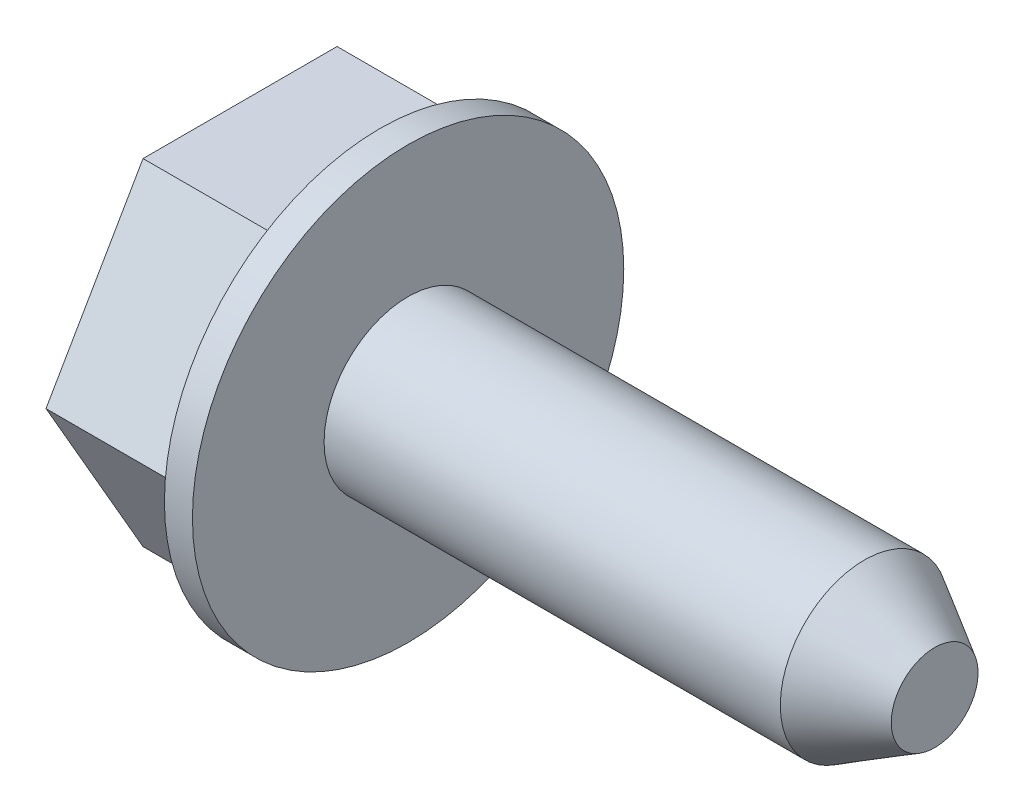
ISO-10303-21;
HEADER;
FILE_DESCRIPTION(('STEP AP214'),'2;1');
FILE_NAME('part.step','',(''),(''),'','','');
FILE_SCHEMA(('AUTOMOTIVE_DESIGN { 1 0 10303 214 1 1 1 1 }'));
ENDSEC;
DATA;
#1=APPLICATION_CONTEXT('core data for automotive mechanical design processes');
#2=APPLICATION_PROTOCOL_DEFINITION('international standard','automotive_design',2000,#1);
#3=PRODUCT_CONTEXT('',#1,'mechanical');
#4=PRODUCT('Part','Part','',(#3));
#5=PRODUCT_RELATED_PRODUCT_CATEGORY('part','',(#4));
#6=PRODUCT_DEFINITION_FORMATION('','',#4);
#7=PRODUCT_DEFINITION_CONTEXT('part definition',#1,'design');
#8=PRODUCT_DEFINITION('design','',#6,#7);
#9=PRODUCT_DEFINITION_SHAPE('','',#8);
#10=(LENGTH_UNIT() NAMED_UNIT(*) SI_UNIT(.MILLI.,.METRE.));
#11=(NAMED_UNIT(*) PLANE_ANGLE_UNIT() SI_UNIT($,.RADIAN.));
#12=(NAMED_UNIT(*) SI_UNIT($,.STERADIAN.) SOLID_ANGLE_UNIT());
#13=UNCERTAINTY_MEASURE_WITH_UNIT(LENGTH_MEASURE(1.E-05),#10,'distance_accuracy_value','');
#14=(GEOMETRIC_REPRESENTATION_CONTEXT(3) GLOBAL_UNCERTAINTY_ASSIGNED_CONTEXT((#13)) GLOBAL_UNIT_ASSIGNED_CONTEXT((#10,
#11,#12)) REPRESENTATION_CONTEXT('',''));
#15=CARTESIAN_POINT('',(0.,0.,0.));
#16=DIRECTION('',(0.,0.,1.));
#17=DIRECTION('',(1.,0.,0.));
#18=AXIS2_PLACEMENT_3D('',#15,#16,#17);
#19=CARTESIAN_POINT('',(0.,0.,0.));
#20=DIRECTION('',(-1.,0.,0.));
#21=DIRECTION('',(0.,0.,1.));
#22=AXIS2_PLACEMENT_3D('',#19,#20,#21);
#23=CYLINDRICAL_SURFACE('',#22,0.762);
#24=CARTESIAN_POINT('',(0.,0.,0.));
#25=DIRECTION('',(-1.,0.,0.));
#26=DIRECTION('',(0.,0.,1.));
#27=AXIS2_PLACEMENT_3D('',#24,#25,#26);
#28=CIRCLE('',#27,0.762);
#29=CARTESIAN_POINT('',(0.,0.,0.762));
#30=VERTEX_POINT('',#29);
#31=EDGE_CURVE('E80',#30,#30,#28,.T.);
#32=ORIENTED_EDGE('',*,*,#31,.F.);
#33=EDGE_LOOP('',(#32));
#34=FACE_BOUND('',#33,.T.);
#35=CARTESIAN_POINT('',(4.13728568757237,0.,0.));
#36=DIRECTION('',(-1.,0.,0.));
#37=DIRECTION('',(0.,0.,1.));
#38=AXIS2_PLACEMENT_3D('',#35,#36,#37);
#39=CIRCLE('',#38,0.762);
#40=CARTESIAN_POINT('',(4.13728568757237,0.,0.762));
#41=VERTEX_POINT('',#40);
#42=EDGE_CURVE('E185',#41,#41,#39,.T.);
#43=ORIENTED_EDGE('',*,*,#42,.T.);
#44=EDGE_LOOP('',(#43));
#45=FACE_BOUND('',#44,.T.);
#46=ADVANCED_FACE('F106',(#34,#45),#23,.T.);
#47=CARTESIAN_POINT('',(-1.27,1.2192,0.));
#48=DIRECTION('',(1.,0.,0.));
#49=DIRECTION('',(0.,0.,-1.));
#50=AXIS2_PLACEMENT_3D('',#47,#48,#49);
#51=PLANE('',#50);
#52=CARTESIAN_POINT('',(-1.27,0.,0.));
#53=DIRECTION('',(-1.,0.,0.));
#54=DIRECTION('',(0.,0.,1.));
#55=AXIS2_PLACEMENT_3D('',#52,#53,#54);
#56=CIRCLE('',#55,1.2192);
#57=CARTESIAN_POINT('',(-1.27,0.,1.2192));
#58=VERTEX_POINT('',#57);
#59=EDGE_CURVE('E217',#58,#58,#56,.T.);
#60=ORIENTED_EDGE('',*,*,#59,.T.);
#61=EDGE_LOOP('',(#60));
#62=FACE_BOUND('',#61,.T.);
#63=ADVANCED_FACE('F108',(#62),#51,.F.);
#64=CARTESIAN_POINT('',(0.,0.762,0.));
#65=DIRECTION('',(-1.,0.,0.));
#66=DIRECTION('',(0.,0.,1.));
#67=AXIS2_PLACEMENT_3D('',#64,#65,#66);
#68=PLANE('',#67);
#69=CARTESIAN_POINT('',(0.,0.,0.));
#70=DIRECTION('',(-1.,0.,0.));
#71=DIRECTION('',(0.,0.,1.));
#72=AXIS2_PLACEMENT_3D('',#69,#70,#71);
#73=CIRCLE('',#72,1.9558);
#74=CARTESIAN_POINT('',(0.,0.,1.9558));
#75=VERTEX_POINT('',#74);
#76=EDGE_CURVE('E114',#75,#75,#73,.T.);
#77=ORIENTED_EDGE('',*,*,#76,.F.);
#78=EDGE_LOOP('',(#77));
#79=FACE_BOUND('',#78,.T.);
#80=ORIENTED_EDGE('',*,*,#31,.T.);
#81=EDGE_LOOP('',(#80));
#82=FACE_BOUND('',#81,.T.);
#83=ADVANCED_FACE('F231',(#79,#82),#68,.F.);
#84=CARTESIAN_POINT('',(0.,0.,0.));
#85=DIRECTION('',(-1.,0.,0.));
#86=DIRECTION('',(0.,0.,1.));
#87=AXIS2_PLACEMENT_3D('',#84,#85,#86);
#88=CYLINDRICAL_SURFACE('',#87,1.9558);
#89=CARTESIAN_POINT('',(-0.254,0.,0.));
#90=DIRECTION('',(-1.,0.,0.));
#91=DIRECTION('',(0.,0.,1.));
#92=AXIS2_PLACEMENT_3D('',#89,#90,#91);
#93=CIRCLE('',#92,1.9558);
#94=CARTESIAN_POINT('',(-0.254,0.,1.9558));
#95=VERTEX_POINT('',#94);
#96=EDGE_CURVE('E224',#95,#95,#93,.T.);
#97=ORIENTED_EDGE('',*,*,#96,.F.);
#98=EDGE_LOOP('',(#97));
#99=FACE_BOUND('',#98,.T.);
#100=ORIENTED_EDGE('',*,*,#76,.T.);
#101=EDGE_LOOP('',(#100));
#102=FACE_BOUND('',#101,.T.);
#103=ADVANCED_FACE('F229',(#99,#102),#88,.T.);
#104=CARTESIAN_POINT('',(-0.254,1.9558,0.));
#105=DIRECTION('',(1.,0.,0.));
#106=DIRECTION('',(0.,0.,-1.));
#107=AXIS2_PLACEMENT_3D('',#104,#105,#106);
#108=PLANE('',#107);
#109=DIRECTION('',(0.,0.,1.));
#110=VECTOR('',#109,1.);
#111=CARTESIAN_POINT('',(-0.253999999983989,-1.524,0.));
#112=LINE('',#111,#110);
#113=CARTESIAN_POINT('',(-0.254,-1.524,-0.87988181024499));
#114=VERTEX_POINT('',#113);
#115=CARTESIAN_POINT('',(-0.254,-1.524,0.879881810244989));
#116=VERTEX_POINT('',#115);
#117=EDGE_CURVE('E180',#114,#116,#112,.T.);
#118=ORIENTED_EDGE('',*,*,#117,.F.);
#119=DIRECTION('',(0.,-0.866025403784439,0.5));
#120=VECTOR('',#119,1.);
#121=CARTESIAN_POINT('',(-0.253999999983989,-0.762000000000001,-1.31982271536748));
#122=LINE('',#121,#120);
#123=CARTESIAN_POINT('',(-0.253999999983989,0.,-1.75976362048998));
#124=VERTEX_POINT('',#123);
#125=EDGE_CURVE('E121',#124,#114,#122,.T.);
#126=ORIENTED_EDGE('',*,*,#125,.F.);
#127=DIRECTION('',(0.,-0.866025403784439,-0.5));
#128=VECTOR('',#127,1.);
#129=CARTESIAN_POINT('',(-0.253999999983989,0.762,-1.31982271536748));
#130=LINE('',#129,#128);
#131=CARTESIAN_POINT('',(-0.254,1.524,-0.87988181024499));
#132=VERTEX_POINT('',#131);
#133=EDGE_CURVE('E211',#132,#124,#130,.T.);
#134=ORIENTED_EDGE('',*,*,#133,.F.);
#135=DIRECTION('',(0.,0.,-1.));
#136=VECTOR('',#135,1.);
#137=CARTESIAN_POINT('',(-0.253999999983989,1.524,0.));
#138=LINE('',#137,#136);
#139=CARTESIAN_POINT('',(-0.254,1.524,0.879881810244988));
#140=VERTEX_POINT('',#139);
#141=EDGE_CURVE('E203',#140,#132,#138,.T.);
#142=ORIENTED_EDGE('',*,*,#141,.F.);
#143=DIRECTION('',(0.,0.866025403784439,-0.5));
#144=VECTOR('',#143,1.);
#145=CARTESIAN_POINT('',(-0.253999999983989,0.762,1.31982271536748));
#146=LINE('',#145,#144);
#147=CARTESIAN_POINT('',(-0.254,0.,1.75976362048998));
#148=VERTEX_POINT('',#147);
#149=EDGE_CURVE('E195',#148,#140,#146,.T.);
#150=ORIENTED_EDGE('',*,*,#149,.F.);
#151=DIRECTION('',(0.,0.866025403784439,0.5));
#152=VECTOR('',#151,1.);
#153=CARTESIAN_POINT('',(-0.253999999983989,-0.762,1.31982271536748));
#154=LINE('',#153,#152);
#155=EDGE_CURVE('E128',#116,#148,#154,.T.);
#156=ORIENTED_EDGE('',*,*,#155,.F.);
#157=EDGE_LOOP('',(#118,#126,#134,#142,#150,#156));
#158=FACE_BOUND('',#157,.T.);
#159=ORIENTED_EDGE('',*,*,#96,.T.);
#160=EDGE_LOOP('',(#159));
#161=FACE_BOUND('',#160,.T.);
#162=ADVANCED_FACE('F279',(#158,#161),#108,.F.);
#163=CARTESIAN_POINT('',(-1.524,1.524,0.));
#164=DIRECTION('',(1.,0.,0.));
#165=DIRECTION('',(0.,0.,-1.));
#166=AXIS2_PLACEMENT_3D('',#163,#164,#165);
#167=PLANE('',#166);
#168=CARTESIAN_POINT('',(-1.524,0.,0.));
#169=DIRECTION('',(-1.,0.,0.));
#170=DIRECTION('',(0.,0.,1.));
#171=AXIS2_PLACEMENT_3D('',#168,#169,#170);
#172=CIRCLE('',#171,1.2192);
#173=CARTESIAN_POINT('',(-1.524,0.,1.2192));
#174=VERTEX_POINT('',#173);
#175=EDGE_CURVE('E221',#174,#174,#172,.T.);
#176=ORIENTED_EDGE('',*,*,#175,.F.);
#177=EDGE_LOOP('',(#176));
#178=FACE_BOUND('',#177,.T.);
#179=DIRECTION('',(0.,-0.866025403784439,0.5));
#180=VECTOR('',#179,1.);
#181=CARTESIAN_POINT('',(-1.524,-0.762000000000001,-1.31982271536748));
#182=LINE('',#181,#180);
#183=CARTESIAN_POINT('',(-1.524,0.,-1.75976362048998));
#184=VERTEX_POINT('',#183);
#185=CARTESIAN_POINT('',(-1.524,-1.524,-0.87988181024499));
#186=VERTEX_POINT('',#185);
#187=EDGE_CURVE('E162',#184,#186,#182,.T.);
#188=ORIENTED_EDGE('',*,*,#187,.T.);
#189=DIRECTION('',(0.,0.,1.));
#190=VECTOR('',#189,1.);
#191=CARTESIAN_POINT('',(-1.524,-1.524,0.));
#192=LINE('',#191,#190);
#193=CARTESIAN_POINT('',(-1.524,-1.524,0.879881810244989));
#194=VERTEX_POINT('',#193);
#195=EDGE_CURVE('E166',#186,#194,#192,.T.);
#196=ORIENTED_EDGE('',*,*,#195,.T.);
#197=DIRECTION('',(0.,0.866025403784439,0.5));
#198=VECTOR('',#197,1.);
#199=CARTESIAN_POINT('',(-1.524,-0.762,1.31982271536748));
#200=LINE('',#199,#198);
#201=CARTESIAN_POINT('',(-1.524,0.,1.75976362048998));
#202=VERTEX_POINT('',#201);
#203=EDGE_CURVE('E193',#194,#202,#200,.T.);
#204=ORIENTED_EDGE('',*,*,#203,.T.);
#205=DIRECTION('',(0.,0.866025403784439,-0.5));
#206=VECTOR('',#205,1.);
#207=CARTESIAN_POINT('',(-1.524,0.762,1.31982271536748));
#208=LINE('',#207,#206);
#209=CARTESIAN_POINT('',(-1.524,1.524,0.879881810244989));
#210=VERTEX_POINT('',#209);
#211=EDGE_CURVE('E200',#202,#210,#208,.T.);
#212=ORIENTED_EDGE('',*,*,#211,.T.);
#213=DIRECTION('',(0.,0.,-1.));
#214=VECTOR('',#213,1.);
#215=CARTESIAN_POINT('',(-1.524,1.524,0.));
#216=LINE('',#215,#214);
#217=CARTESIAN_POINT('',(-1.524,1.524,-0.87988181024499));
#218=VERTEX_POINT('',#217);
#219=EDGE_CURVE('E209',#210,#218,#216,.T.);
#220=ORIENTED_EDGE('',*,*,#219,.T.);
#221=DIRECTION('',(0.,-0.866025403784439,-0.5));
#222=VECTOR('',#221,1.);
#223=CARTESIAN_POINT('',(-1.524,0.762,-1.31982271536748));
#224=LINE('',#223,#222);
#225=EDGE_CURVE('E168',#218,#184,#224,.T.);
#226=ORIENTED_EDGE('',*,*,#225,.T.);
#227=EDGE_LOOP('',(#188,#196,#204,#212,#220,#226));
#228=FACE_BOUND('',#227,.T.);
#229=ADVANCED_FACE('F164',(#178,#228),#167,.F.);
#230=CARTESIAN_POINT('',(0.,0.,0.));
#231=DIRECTION('',(-1.,0.,0.));
#232=DIRECTION('',(0.,0.,1.));
#233=AXIS2_PLACEMENT_3D('',#230,#231,#232);
#234=CYLINDRICAL_SURFACE('',#233,1.2192);
#235=ORIENTED_EDGE('',*,*,#59,.F.);
#236=EDGE_LOOP('',(#235));
#237=FACE_BOUND('',#236,.T.);
#238=ORIENTED_EDGE('',*,*,#175,.T.);
#239=EDGE_LOOP('',(#238));
#240=FACE_BOUND('',#239,.T.);
#241=ADVANCED_FACE('F270',(#237,#240),#234,.F.);
#242=CARTESIAN_POINT('',(500000.,-0.762000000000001,-1.31982271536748));
#243=DIRECTION('',(0.,-0.5,-0.866025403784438));
#244=DIRECTION('',(0.,0.866025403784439,-0.5));
#245=AXIS2_PLACEMENT_3D('',#242,#243,#244);
#246=PLANE('',#245);
#247=DIRECTION('',(-1.,0.,0.));
#248=VECTOR('',#247,1.);
#249=CARTESIAN_POINT('',(500000.,0.,-1.75976362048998));
#250=LINE('',#249,#248);
#251=EDGE_CURVE('E169',#124,#184,#250,.T.);
#252=ORIENTED_EDGE('',*,*,#251,.F.);
#253=ORIENTED_EDGE('',*,*,#125,.T.);
#254=DIRECTION('',(-1.,0.,0.));
#255=VECTOR('',#254,1.);
#256=CARTESIAN_POINT('',(500000.,-1.524,-0.87988181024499));
#257=LINE('',#256,#255);
#258=EDGE_CURVE('E175',#114,#186,#257,.T.);
#259=ORIENTED_EDGE('',*,*,#258,.T.);
#260=ORIENTED_EDGE('',*,*,#187,.F.);
#261=EDGE_LOOP('',(#252,#253,#259,#260));
#262=FACE_BOUND('',#261,.T.);
#263=ADVANCED_FACE('F179',(#262),#246,.T.);
#264=CARTESIAN_POINT('',(500000.,0.762,-1.31982271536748));
#265=DIRECTION('',(0.,0.5,-0.866025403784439));
#266=DIRECTION('',(0.,0.866025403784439,0.5));
#267=AXIS2_PLACEMENT_3D('',#264,#265,#266);
#268=PLANE('',#267);
#269=ORIENTED_EDGE('',*,*,#225,.F.);
#270=DIRECTION('',(-1.,0.,0.));
#271=VECTOR('',#270,1.);
#272=CARTESIAN_POINT('',(500000.,1.524,-0.87988181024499));
#273=LINE('',#272,#271);
#274=EDGE_CURVE('E206',#132,#218,#273,.T.);
#275=ORIENTED_EDGE('',*,*,#274,.F.);
#276=ORIENTED_EDGE('',*,*,#133,.T.);
#277=ORIENTED_EDGE('',*,*,#251,.T.);
#278=EDGE_LOOP('',(#269,#275,#276,#277));
#279=FACE_BOUND('',#278,.T.);
#280=ADVANCED_FACE('F266',(#279),#268,.T.);
#281=CARTESIAN_POINT('',(500000.,1.524,0.));
#282=DIRECTION('',(0.,1.,0.));
#283=DIRECTION('',(0.,0.,1.));
#284=AXIS2_PLACEMENT_3D('',#281,#282,#283);
#285=PLANE('',#284);
#286=ORIENTED_EDGE('',*,*,#219,.F.);
#287=DIRECTION('',(-1.,0.,0.));
#288=VECTOR('',#287,1.);
#289=CARTESIAN_POINT('',(500000.,1.524,0.879881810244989));
#290=LINE('',#289,#288);
#291=EDGE_CURVE('E197',#140,#210,#290,.T.);
#292=ORIENTED_EDGE('',*,*,#291,.F.);
#293=ORIENTED_EDGE('',*,*,#141,.T.);
#294=ORIENTED_EDGE('',*,*,#274,.T.);
#295=EDGE_LOOP('',(#286,#292,#293,#294));
#296=FACE_BOUND('',#295,.T.);
#297=ADVANCED_FACE('F262',(#296),#285,.T.);
#298=CARTESIAN_POINT('',(500000.,0.762,1.31982271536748));
#299=DIRECTION('',(0.,0.5,0.866025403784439));
#300=DIRECTION('',(0.,-0.866025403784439,0.5));
#301=AXIS2_PLACEMENT_3D('',#298,#299,#300);
#302=PLANE('',#301);
#303=ORIENTED_EDGE('',*,*,#211,.F.);
#304=DIRECTION('',(-1.,0.,0.));
#305=VECTOR('',#304,1.);
#306=CARTESIAN_POINT('',(500000.,0.,1.75976362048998));
#307=LINE('',#306,#305);
#308=EDGE_CURVE('E190',#148,#202,#307,.T.);
#309=ORIENTED_EDGE('',*,*,#308,.F.);
#310=ORIENTED_EDGE('',*,*,#149,.T.);
#311=ORIENTED_EDGE('',*,*,#291,.T.);
#312=EDGE_LOOP('',(#303,#309,#310,#311));
#313=FACE_BOUND('',#312,.T.);
#314=ADVANCED_FACE('F258',(#313),#302,.T.);
#315=CARTESIAN_POINT('',(500000.,-0.762,1.31982271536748));
#316=DIRECTION('',(0.,-0.5,0.866025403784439));
#317=DIRECTION('',(0.,-0.866025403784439,-0.5));
#318=AXIS2_PLACEMENT_3D('',#315,#316,#317);
#319=PLANE('',#318);
#320=ORIENTED_EDGE('',*,*,#203,.F.);
#321=DIRECTION('',(-1.,0.,0.));
#322=VECTOR('',#321,1.);
#323=CARTESIAN_POINT('',(500000.,-1.524,0.879881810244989));
#324=LINE('',#323,#322);
#325=EDGE_CURVE('E177',#116,#194,#324,.T.);
#326=ORIENTED_EDGE('',*,*,#325,.F.);
#327=ORIENTED_EDGE('',*,*,#155,.T.);
#328=ORIENTED_EDGE('',*,*,#308,.T.);
#329=EDGE_LOOP('',(#320,#326,#327,#328));
#330=FACE_BOUND('',#329,.T.);
#331=ADVANCED_FACE('F253',(#330),#319,.T.);
#332=CARTESIAN_POINT('',(500000.,-1.524,0.));
#333=DIRECTION('',(0.,-1.,0.));
#334=DIRECTION('',(0.,0.,-1.));
#335=AXIS2_PLACEMENT_3D('',#332,#333,#334);
#336=PLANE('',#335);
#337=ORIENTED_EDGE('',*,*,#195,.F.);
#338=ORIENTED_EDGE('',*,*,#258,.F.);
#339=ORIENTED_EDGE('',*,*,#117,.T.);
#340=ORIENTED_EDGE('',*,*,#325,.T.);
#341=EDGE_LOOP('',(#337,#338,#339,#340));
#342=FACE_BOUND('',#341,.T.);
#343=ADVANCED_FACE('F174',(#342),#336,.T.);
#344=CARTESIAN_POINT('',(4.13728568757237,0.,0.));
#345=DIRECTION('',(-1.,0.,0.));
#346=DIRECTION('',(0.,0.,1.));
#347=AXIS2_PLACEMENT_3D('',#344,#345,#346);
#348=CONICAL_SURFACE('',#347,0.762,0.523598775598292);
#349=CARTESIAN_POINT('',(4.7752,0.,0.));
#350=DIRECTION('',(-1.,0.,0.));
#351=DIRECTION('',(0.,0.,1.));
#352=AXIS2_PLACEMENT_3D('',#349,#350,#351);
#353=CIRCLE('',#352,0.3937);
#354=CARTESIAN_POINT('',(4.7752,0.,0.3937));
#355=VERTEX_POINT('',#354);
#356=EDGE_CURVE('E181',#355,#355,#353,.T.);
#357=ORIENTED_EDGE('',*,*,#356,.T.);
#358=EDGE_LOOP('',(#357));
#359=FACE_BOUND('',#358,.T.);
#360=ORIENTED_EDGE('',*,*,#42,.F.);
#361=EDGE_LOOP('',(#360));
#362=FACE_BOUND('',#361,.T.);
#363=ADVANCED_FACE('F243',(#359,#362),#348,.T.);
#364=CARTESIAN_POINT('',(4.7752,0.762,0.));
#365=DIRECTION('',(-1.,0.,0.));
#366=DIRECTION('',(0.,0.,1.));
#367=AXIS2_PLACEMENT_3D('',#364,#365,#366);
#368=PLANE('',#367);
#369=ORIENTED_EDGE('',*,*,#356,.F.);
#370=EDGE_LOOP('',(#369));
#371=FACE_BOUND('',#370,.T.);
#372=ADVANCED_FACE('F245',(#371),#368,.F.);
#373=CLOSED_SHELL('',(#46,#63,#83,#103,#162,#229,#241,#263,#280,#297,#314,#331,#343,#363,#372));
#374=MANIFOLD_SOLID_BREP('B7',#373);
#375=ADVANCED_BREP_SHAPE_REPRESENTATION('',(#18,#374),#14);
#376=SHAPE_DEFINITION_REPRESENTATION(#9,#375);
ENDSEC;
END-ISO-10303-21;
